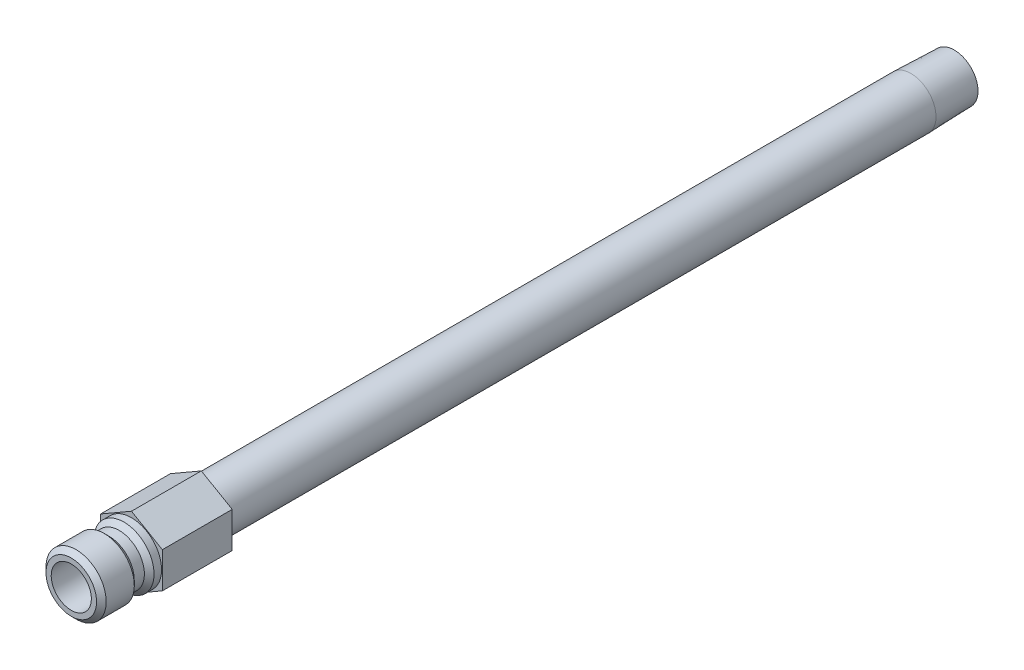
from build123d import *

# Parameters (mm, degrees)
SKETCH2_R           = 2.38125
BOSS_EXTRUDE1_DEPTH = 11.049


with BuildPart() as part:
    # Sketch1 → Revolve1 (revolve)
    with BuildSketch(Plane(origin=(0, 0, 0), x_dir=(0, 0, -1), z_dir=(1, 0, 0))):
        Polygon((-9.525, 3.175), (-9.525, 4.0005), (-8.763, 4.7625), (-4.318, 4.7625), (-3.556, 4.0005), (-1.9558, 4.0005), (-1.1938, 4.7625), (0, 4.7625), (0, 3.96875), (123.317, 3.96875), (130.175, 3.754438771), (130.175, 2.38125), (0.127, 2.38125), (0.127, 3.175), align=None)
    revolve(axis=Axis((0, 0, 0), (0, 0, 1)))

    # Sketch2 → Boss-Extrude1 (add)
    with BuildSketch(Plane.XY):
        Polygon((-4.8895, 2.822954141), (-4.8895, -2.822954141), (0, -5.645908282), (4.8895, -2.822954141), (4.8895, 2.822954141), (0, 5.645908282), align=None)
        with Locations(Location((0, 0, 0), (0, 0, 90))):
            Circle(SKETCH2_R, mode=Mode.SUBTRACT)
    extrude(amount=-BOSS_EXTRUDE1_DEPTH)


solid = part.part
